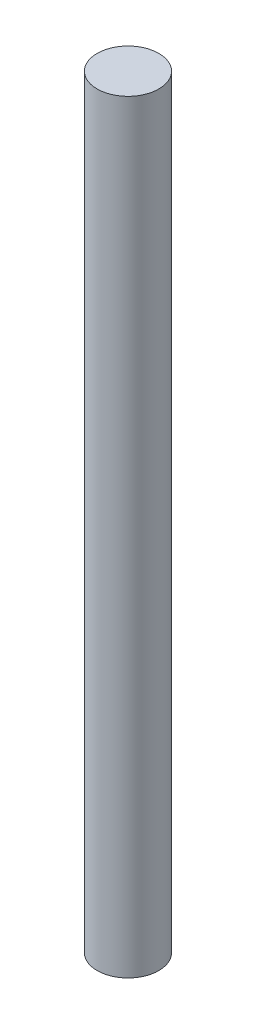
ISO-10303-21;
HEADER;
FILE_DESCRIPTION(('STEP AP214'),'2;1');
FILE_NAME('part.step','',(''),(''),'','','');
FILE_SCHEMA(('AUTOMOTIVE_DESIGN { 1 0 10303 214 1 1 1 1 }'));
ENDSEC;
DATA;
#1=APPLICATION_CONTEXT('core data for automotive mechanical design processes');
#2=APPLICATION_PROTOCOL_DEFINITION('international standard','automotive_design',2000,#1);
#3=PRODUCT_CONTEXT('',#1,'mechanical');
#4=PRODUCT('Part','Part','',(#3));
#5=PRODUCT_RELATED_PRODUCT_CATEGORY('part','',(#4));
#6=PRODUCT_DEFINITION_FORMATION('','',#4);
#7=PRODUCT_DEFINITION_CONTEXT('part definition',#1,'design');
#8=PRODUCT_DEFINITION('design','',#6,#7);
#9=PRODUCT_DEFINITION_SHAPE('','',#8);
#10=(LENGTH_UNIT() NAMED_UNIT(*) SI_UNIT(.MILLI.,.METRE.));
#11=(NAMED_UNIT(*) PLANE_ANGLE_UNIT() SI_UNIT($,.RADIAN.));
#12=(NAMED_UNIT(*) SI_UNIT($,.STERADIAN.) SOLID_ANGLE_UNIT());
#13=UNCERTAINTY_MEASURE_WITH_UNIT(LENGTH_MEASURE(1.E-05),#10,'distance_accuracy_value','');
#14=(GEOMETRIC_REPRESENTATION_CONTEXT(3) GLOBAL_UNCERTAINTY_ASSIGNED_CONTEXT((#13)) GLOBAL_UNIT_ASSIGNED_CONTEXT((#10,
#11,#12)) REPRESENTATION_CONTEXT('',''));
#15=CARTESIAN_POINT('',(0.,0.,0.));
#16=DIRECTION('',(0.,0.,1.));
#17=DIRECTION('',(1.,0.,0.));
#18=AXIS2_PLACEMENT_3D('',#15,#16,#17);
#19=CARTESIAN_POINT('',(0.,330.2,0.));
#20=DIRECTION('',(0.,-1.,0.));
#21=DIRECTION('',(0.,0.,-1.));
#22=AXIS2_PLACEMENT_3D('',#19,#20,#21);
#23=CYLINDRICAL_SURFACE('',#22,13.335);
#24=CARTESIAN_POINT('',(0.,330.2,0.));
#25=DIRECTION('',(0.,1.,0.));
#26=DIRECTION('',(0.,0.,1.));
#27=AXIS2_PLACEMENT_3D('',#24,#25,#26);
#28=CIRCLE('',#27,13.335);
#29=CARTESIAN_POINT('',(0.,330.2,13.335));
#30=VERTEX_POINT('',#29);
#31=EDGE_CURVE('E10',#30,#30,#28,.T.);
#32=ORIENTED_EDGE('',*,*,#31,.F.);
#33=EDGE_LOOP('',(#32));
#34=FACE_BOUND('',#33,.T.);
#35=CARTESIAN_POINT('',(0.,0.,0.));
#36=DIRECTION('',(0.,1.,0.));
#37=DIRECTION('',(0.,0.,1.));
#38=AXIS2_PLACEMENT_3D('',#35,#36,#37);
#39=CIRCLE('',#38,13.335);
#40=CARTESIAN_POINT('',(0.,0.,13.335));
#41=VERTEX_POINT('',#40);
#42=EDGE_CURVE('E34',#41,#41,#39,.T.);
#43=ORIENTED_EDGE('',*,*,#42,.T.);
#44=EDGE_LOOP('',(#43));
#45=FACE_BOUND('',#44,.T.);
#46=ADVANCED_FACE('F31',(#34,#45),#23,.T.);
#47=CARTESIAN_POINT('',(0.,330.2,0.));
#48=DIRECTION('',(0.,1.,0.));
#49=DIRECTION('',(0.,0.,1.));
#50=AXIS2_PLACEMENT_3D('',#47,#48,#49);
#51=PLANE('',#50);
#52=ORIENTED_EDGE('',*,*,#31,.T.);
#53=EDGE_LOOP('',(#52));
#54=FACE_BOUND('',#53,.T.);
#55=ADVANCED_FACE('F46',(#54),#51,.T.);
#56=CARTESIAN_POINT('',(0.,0.,0.));
#57=DIRECTION('',(0.,1.,0.));
#58=DIRECTION('',(0.,0.,1.));
#59=AXIS2_PLACEMENT_3D('',#56,#57,#58);
#60=PLANE('',#59);
#61=ORIENTED_EDGE('',*,*,#42,.F.);
#62=EDGE_LOOP('',(#61));
#63=FACE_BOUND('',#62,.T.);
#64=ADVANCED_FACE('F44',(#63),#60,.F.);
#65=CLOSED_SHELL('',(#46,#55,#64));
#66=MANIFOLD_SOLID_BREP('B2',#65);
#67=ADVANCED_BREP_SHAPE_REPRESENTATION('',(#18,#66),#14);
#68=SHAPE_DEFINITION_REPRESENTATION(#9,#67);
ENDSEC;
END-ISO-10303-21;
